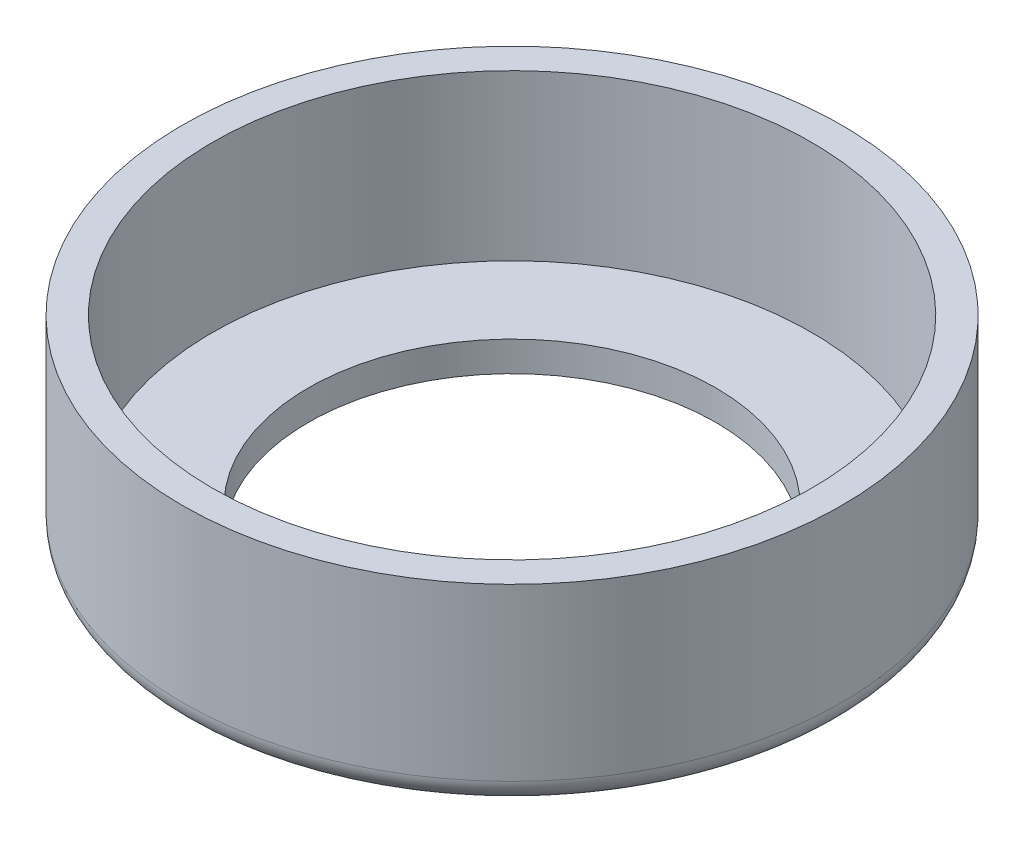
ISO-10303-21;
HEADER;
FILE_DESCRIPTION(('STEP AP214'),'2;1');
FILE_NAME('part.step','',(''),(''),'','','');
FILE_SCHEMA(('AUTOMOTIVE_DESIGN { 1 0 10303 214 1 1 1 1 }'));
ENDSEC;
DATA;
#1=APPLICATION_CONTEXT('core data for automotive mechanical design processes');
#2=APPLICATION_PROTOCOL_DEFINITION('international standard','automotive_design',2000,#1);
#3=PRODUCT_CONTEXT('',#1,'mechanical');
#4=PRODUCT('Part','Part','',(#3));
#5=PRODUCT_RELATED_PRODUCT_CATEGORY('part','',(#4));
#6=PRODUCT_DEFINITION_FORMATION('','',#4);
#7=PRODUCT_DEFINITION_CONTEXT('part definition',#1,'design');
#8=PRODUCT_DEFINITION('design','',#6,#7);
#9=PRODUCT_DEFINITION_SHAPE('','',#8);
#10=(LENGTH_UNIT() NAMED_UNIT(*) SI_UNIT(.MILLI.,.METRE.));
#11=(NAMED_UNIT(*) PLANE_ANGLE_UNIT() SI_UNIT($,.RADIAN.));
#12=(NAMED_UNIT(*) SI_UNIT($,.STERADIAN.) SOLID_ANGLE_UNIT());
#13=UNCERTAINTY_MEASURE_WITH_UNIT(LENGTH_MEASURE(1.E-05),#10,'distance_accuracy_value','');
#14=(GEOMETRIC_REPRESENTATION_CONTEXT(3) GLOBAL_UNCERTAINTY_ASSIGNED_CONTEXT((#13)) GLOBAL_UNIT_ASSIGNED_CONTEXT((#10,
#11,#12)) REPRESENTATION_CONTEXT('',''));
#15=CARTESIAN_POINT('',(0.,0.,0.));
#16=DIRECTION('',(0.,0.,1.));
#17=DIRECTION('',(1.,0.,0.));
#18=AXIS2_PLACEMENT_3D('',#15,#16,#17);
#19=CARTESIAN_POINT('',(0.,10.3124,0.));
#20=DIRECTION('',(0.,-1.,0.));
#21=DIRECTION('',(0.,0.,-1.));
#22=AXIS2_PLACEMENT_3D('',#19,#20,#21);
#23=CYLINDRICAL_SURFACE('',#22,17.4625);
#24=CARTESIAN_POINT('',(0.,1.27,0.));
#25=DIRECTION('',(0.,1.,0.));
#26=DIRECTION('',(0.,0.,1.));
#27=AXIS2_PLACEMENT_3D('',#24,#25,#26);
#28=CIRCLE('',#27,17.4625);
#29=CARTESIAN_POINT('',(0.,1.27,17.4625));
#30=VERTEX_POINT('',#29);
#31=EDGE_CURVE('E41',#30,#30,#28,.T.);
#32=ORIENTED_EDGE('',*,*,#31,.T.);
#33=EDGE_LOOP('',(#32));
#34=FACE_BOUND('',#33,.T.);
#35=CARTESIAN_POINT('',(0.,10.3124,0.));
#36=DIRECTION('',(0.,1.,0.));
#37=DIRECTION('',(0.,0.,1.));
#38=AXIS2_PLACEMENT_3D('',#35,#36,#37);
#39=CIRCLE('',#38,17.4625);
#40=CARTESIAN_POINT('',(0.,10.3124,17.4625));
#41=VERTEX_POINT('',#40);
#42=EDGE_CURVE('E45',#41,#41,#39,.T.);
#43=ORIENTED_EDGE('',*,*,#42,.F.);
#44=EDGE_LOOP('',(#43));
#45=FACE_BOUND('',#44,.T.);
#46=ADVANCED_FACE('F34',(#34,#45),#23,.T.);
#47=CARTESIAN_POINT('',(0.,10.3124,0.));
#48=DIRECTION('',(0.,1.,0.));
#49=DIRECTION('',(0.,0.,1.));
#50=AXIS2_PLACEMENT_3D('',#47,#48,#49);
#51=PLANE('',#50);
#52=CARTESIAN_POINT('',(0.,10.3124,0.));
#53=DIRECTION('',(0.,1.,0.));
#54=DIRECTION('',(0.,0.,1.));
#55=AXIS2_PLACEMENT_3D('',#52,#53,#54);
#56=CIRCLE('',#55,15.875);
#57=CARTESIAN_POINT('',(0.,10.3124,15.875));
#58=VERTEX_POINT('',#57);
#59=EDGE_CURVE('E51',#58,#58,#56,.T.);
#60=ORIENTED_EDGE('',*,*,#59,.F.);
#61=EDGE_LOOP('',(#60));
#62=FACE_BOUND('',#61,.T.);
#63=ORIENTED_EDGE('',*,*,#42,.T.);
#64=EDGE_LOOP('',(#63));
#65=FACE_BOUND('',#64,.T.);
#66=ADVANCED_FACE('F78',(#62,#65),#51,.T.);
#67=CARTESIAN_POINT('',(0.,0.,0.));
#68=DIRECTION('',(0.,1.,0.));
#69=DIRECTION('',(0.,0.,1.));
#70=AXIS2_PLACEMENT_3D('',#67,#68,#69);
#71=PLANE('',#70);
#72=CARTESIAN_POINT('',(0.,0.,0.));
#73=DIRECTION('',(0.,-1.,0.));
#74=DIRECTION('',(0.,0.,-1.));
#75=AXIS2_PLACEMENT_3D('',#72,#73,#74);
#76=CIRCLE('',#75,10.795);
#77=CARTESIAN_POINT('',(0.,0.,-10.795));
#78=VERTEX_POINT('',#77);
#79=EDGE_CURVE('E56',#78,#78,#76,.T.);
#80=ORIENTED_EDGE('',*,*,#79,.F.);
#81=EDGE_LOOP('',(#80));
#82=FACE_BOUND('',#81,.T.);
#83=CARTESIAN_POINT('',(0.,0.,0.));
#84=DIRECTION('',(0.,1.,0.));
#85=DIRECTION('',(0.,0.,1.));
#86=AXIS2_PLACEMENT_3D('',#83,#84,#85);
#87=CIRCLE('',#86,16.1925);
#88=CARTESIAN_POINT('',(0.,0.,16.1925));
#89=VERTEX_POINT('',#88);
#90=EDGE_CURVE('E10',#89,#89,#87,.F.);
#91=ORIENTED_EDGE('',*,*,#90,.T.);
#92=EDGE_LOOP('',(#91));
#93=FACE_BOUND('',#92,.T.);
#94=ADVANCED_FACE('F81',(#82,#93),#71,.F.);
#95=CARTESIAN_POINT('',(0.,1.27,0.));
#96=DIRECTION('',(0.,1.,0.));
#97=DIRECTION('',(0.,0.,1.));
#98=AXIS2_PLACEMENT_3D('',#95,#96,#97);
#99=TOROIDAL_SURFACE('',#98,16.1925,1.27);
#100=ORIENTED_EDGE('',*,*,#90,.F.);
#101=EDGE_LOOP('',(#100));
#102=FACE_BOUND('',#101,.T.);
#103=ORIENTED_EDGE('',*,*,#31,.F.);
#104=EDGE_LOOP('',(#103));
#105=FACE_BOUND('',#104,.T.);
#106=ADVANCED_FACE('F74',(#102,#105),#99,.T.);
#107=CARTESIAN_POINT('',(0.,10.3124,0.));
#108=DIRECTION('',(0.,-1.,0.));
#109=DIRECTION('',(0.,0.,-1.));
#110=AXIS2_PLACEMENT_3D('',#107,#108,#109);
#111=CYLINDRICAL_SURFACE('',#110,15.875);
#112=CARTESIAN_POINT('',(0.,1.5875,0.));
#113=DIRECTION('',(0.,1.,0.));
#114=DIRECTION('',(0.,0.,1.));
#115=AXIS2_PLACEMENT_3D('',#112,#113,#114);
#116=CIRCLE('',#115,15.875);
#117=CARTESIAN_POINT('',(0.,1.5875,15.875));
#118=VERTEX_POINT('',#117);
#119=EDGE_CURVE('E50',#118,#118,#116,.T.);
#120=ORIENTED_EDGE('',*,*,#119,.F.);
#121=EDGE_LOOP('',(#120));
#122=FACE_BOUND('',#121,.T.);
#123=ORIENTED_EDGE('',*,*,#59,.T.);
#124=EDGE_LOOP('',(#123));
#125=FACE_BOUND('',#124,.T.);
#126=ADVANCED_FACE('F68',(#122,#125),#111,.F.);
#127=CARTESIAN_POINT('',(0.,1.5875,0.));
#128=DIRECTION('',(0.,1.,0.));
#129=DIRECTION('',(0.,0.,1.));
#130=AXIS2_PLACEMENT_3D('',#127,#128,#129);
#131=PLANE('',#130);
#132=CARTESIAN_POINT('',(0.,1.5875,0.));
#133=DIRECTION('',(0.,1.,0.));
#134=DIRECTION('',(0.,0.,1.));
#135=AXIS2_PLACEMENT_3D('',#132,#133,#134);
#136=CIRCLE('',#135,10.795);
#137=CARTESIAN_POINT('',(0.,1.5875,10.795));
#138=VERTEX_POINT('',#137);
#139=EDGE_CURVE('E37',#138,#138,#136,.T.);
#140=ORIENTED_EDGE('',*,*,#139,.F.);
#141=EDGE_LOOP('',(#140));
#142=FACE_BOUND('',#141,.T.);
#143=ORIENTED_EDGE('',*,*,#119,.T.);
#144=EDGE_LOOP('',(#143));
#145=FACE_BOUND('',#144,.T.);
#146=ADVANCED_FACE('F65',(#142,#145),#131,.T.);
#147=CARTESIAN_POINT('',(0.,10.3124,0.));
#148=DIRECTION('',(0.,-1.,0.));
#149=DIRECTION('',(0.,0.,-1.));
#150=AXIS2_PLACEMENT_3D('',#147,#148,#149);
#151=CYLINDRICAL_SURFACE('',#150,10.795);
#152=ORIENTED_EDGE('',*,*,#139,.T.);
#153=EDGE_LOOP('',(#152));
#154=FACE_BOUND('',#153,.T.);
#155=ORIENTED_EDGE('',*,*,#79,.T.);
#156=EDGE_LOOP('',(#155));
#157=FACE_BOUND('',#156,.T.);
#158=ADVANCED_FACE('F63',(#154,#157),#151,.F.);
#159=CLOSED_SHELL('',(#46,#66,#94,#106,#126,#146,#158));
#160=MANIFOLD_SOLID_BREP('B2',#159);
#161=ADVANCED_BREP_SHAPE_REPRESENTATION('',(#18,#160),#14);
#162=SHAPE_DEFINITION_REPRESENTATION(#9,#161);
ENDSEC;
END-ISO-10303-21;
